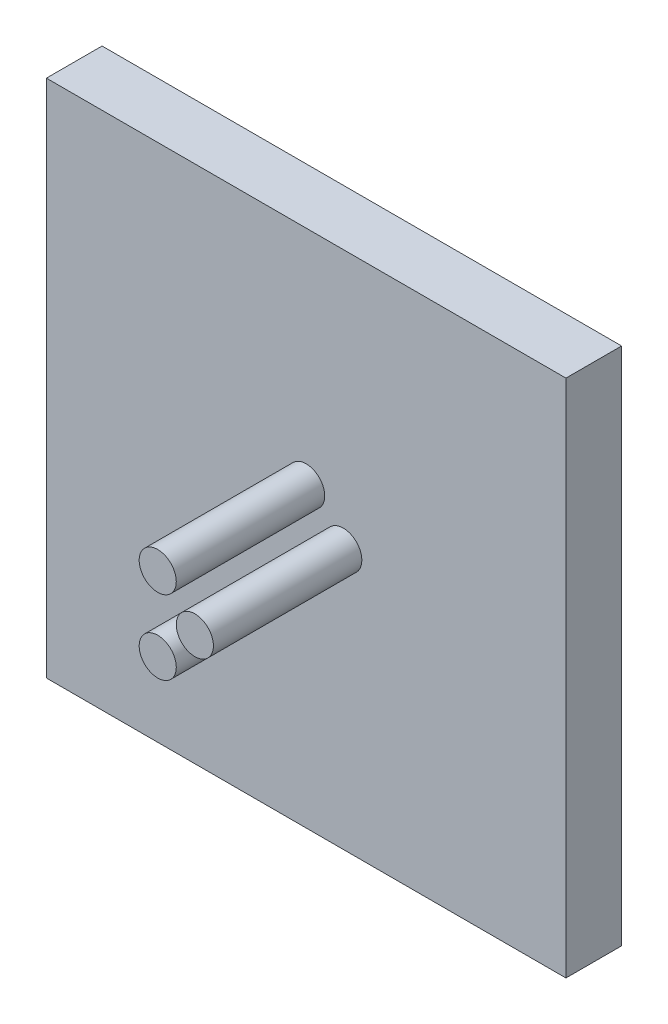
from build123d import *

# Parameters (mm, degrees)
ESQUISSE1_W      = 14
ESQUISSE1_H      = 14
EXTRUSION1_DEPTH = 1.5
ESQUISSE2_R      = 0.5
EXTRUSION2_DEPTH = 4


with BuildPart() as part:
    # Esquisse1 → Extrusion1 (new body)
    with BuildSketch(Plane.XY):
        Rectangle(ESQUISSE1_W, ESQUISSE1_H)
    extrude(amount=EXTRUSION1_DEPTH)

    # Esquisse2 → Extrusion2 (add)
    with BuildSketch(Plane.XY.offset(1.5)):
        with Locations((0, 1)):
            Circle(ESQUISSE2_R)
        with Locations((1, 0)):
            Circle(ESQUISSE2_R)
        with Locations((0, -1)):
            Circle(ESQUISSE2_R)
    extrude(amount=EXTRUSION2_DEPTH)


solid = part.part
